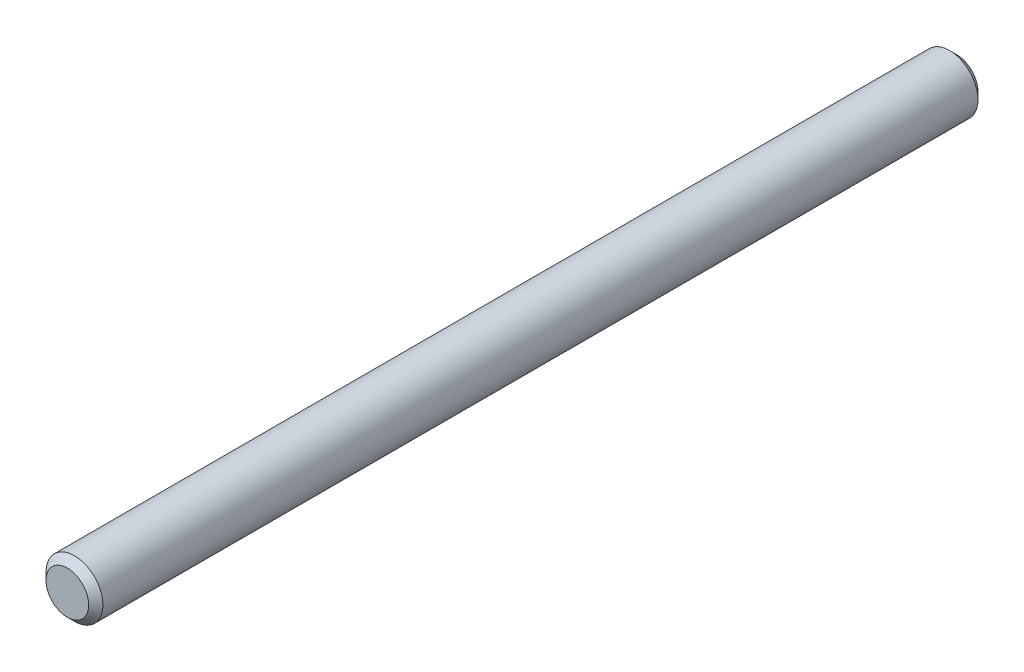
from build123d import *

# Parameters (mm, degrees)
ESQUISSE1_R      = 8
EXTRUSION1_DEPTH = 250
CHANFREIN1_SIZE  = 2


with BuildPart() as part:
    # Esquisse1 → Extrusion1 (new body)
    with BuildSketch(Plane.XY):
        Circle(ESQUISSE1_R)
    extrude(amount=EXTRUSION1_DEPTH)

    # Chanfrein1
    chanfrein1_edges = [part.edges().sort_by_distance(p)[0] for p in [
        (-8, 0, 0),
        (-8, 0, 250),
    ]]
    chamfer(chanfrein1_edges, length=CHANFREIN1_SIZE)


solid = part.part
